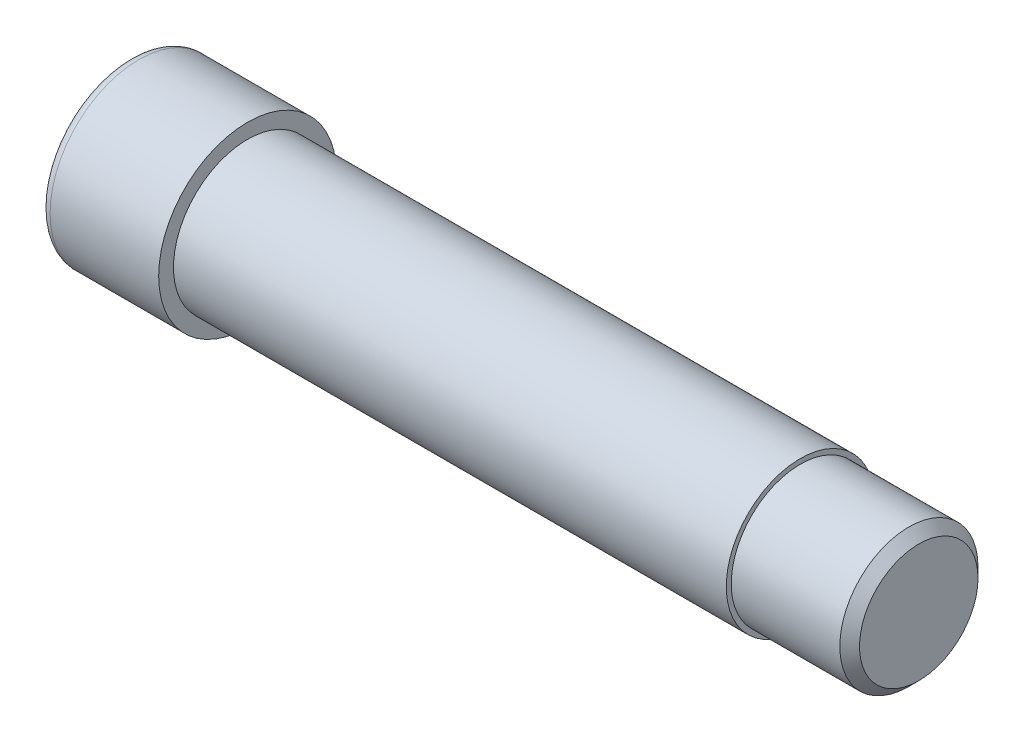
ISO-10303-21;
HEADER;
FILE_DESCRIPTION(('STEP AP214'),'2;1');
FILE_NAME('part.step','',(''),(''),'','','');
FILE_SCHEMA(('AUTOMOTIVE_DESIGN { 1 0 10303 214 1 1 1 1 }'));
ENDSEC;
DATA;
#1=APPLICATION_CONTEXT('core data for automotive mechanical design processes');
#2=APPLICATION_PROTOCOL_DEFINITION('international standard','automotive_design',2000,#1);
#3=PRODUCT_CONTEXT('',#1,'mechanical');
#4=PRODUCT('Part','Part','',(#3));
#5=PRODUCT_RELATED_PRODUCT_CATEGORY('part','',(#4));
#6=PRODUCT_DEFINITION_FORMATION('','',#4);
#7=PRODUCT_DEFINITION_CONTEXT('part definition',#1,'design');
#8=PRODUCT_DEFINITION('design','',#6,#7);
#9=PRODUCT_DEFINITION_SHAPE('','',#8);
#10=(LENGTH_UNIT() NAMED_UNIT(*) SI_UNIT(.MILLI.,.METRE.));
#11=(NAMED_UNIT(*) PLANE_ANGLE_UNIT() SI_UNIT($,.RADIAN.));
#12=(NAMED_UNIT(*) SI_UNIT($,.STERADIAN.) SOLID_ANGLE_UNIT());
#13=UNCERTAINTY_MEASURE_WITH_UNIT(LENGTH_MEASURE(1.E-05),#10,'distance_accuracy_value','');
#14=(GEOMETRIC_REPRESENTATION_CONTEXT(3) GLOBAL_UNCERTAINTY_ASSIGNED_CONTEXT((#13)) GLOBAL_UNIT_ASSIGNED_CONTEXT((#10,
#11,#12)) REPRESENTATION_CONTEXT('',''));
#15=CARTESIAN_POINT('',(0.,0.,0.));
#16=DIRECTION('',(0.,0.,1.));
#17=DIRECTION('',(1.,0.,0.));
#18=AXIS2_PLACEMENT_3D('',#15,#16,#17);
#19=CARTESIAN_POINT('',(-80.,0.,-9.));
#20=DIRECTION('',(-1.,0.,0.));
#21=DIRECTION('',(0.,0.,1.));
#22=AXIS2_PLACEMENT_3D('',#19,#20,#21);
#23=PLANE('',#22);
#24=CARTESIAN_POINT('',(-80.,0.,0.));
#25=DIRECTION('',(-1.,0.,0.));
#26=DIRECTION('',(0.,0.,1.));
#27=AXIS2_PLACEMENT_3D('',#24,#25,#26);
#28=CIRCLE('',#27,8.);
#29=CARTESIAN_POINT('',(-80.,0.,8.));
#30=VERTEX_POINT('',#29);
#31=EDGE_CURVE('E211',#30,#30,#28,.T.);
#32=ORIENTED_EDGE('',*,*,#31,.T.);
#33=EDGE_LOOP('',(#32));
#34=FACE_BOUND('',#33,.T.);
#35=CARTESIAN_POINT('',(-80.,0.,4.42264973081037));
#36=DIRECTION('',(-1.,0.,0.));
#37=DIRECTION('',(0.,0.,1.));
#38=AXIS2_PLACEMENT_3D('',#35,#36,#37);
#39=CIRCLE('',#38,1.);
#40=CARTESIAN_POINT('',(-80.,-0.5,5.28867513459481));
#41=VERTEX_POINT('',#40);
#42=CARTESIAN_POINT('',(-80.,0.5,5.28867513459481));
#43=VERTEX_POINT('',#42);
#44=EDGE_CURVE('E246',#41,#43,#39,.T.);
#45=ORIENTED_EDGE('',*,*,#44,.F.);
#46=DIRECTION('',(0.,0.866025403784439,0.5));
#47=VECTOR('',#46,1.);
#48=CARTESIAN_POINT('',(-80.,-4.5801270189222,2.93301270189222));
#49=LINE('',#48,#47);
#50=CARTESIAN_POINT('',(-80.,-4.33012701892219,3.07735026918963));
#51=VERTEX_POINT('',#50);
#52=EDGE_CURVE('E187',#41,#51,#49,.F.);
#53=ORIENTED_EDGE('',*,*,#52,.T.);
#54=CARTESIAN_POINT('',(-80.,-3.83012701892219,2.21132486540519));
#55=DIRECTION('',(-1.,0.,0.));
#56=DIRECTION('',(0.,0.,1.));
#57=AXIS2_PLACEMENT_3D('',#54,#55,#56);
#58=CIRCLE('',#57,1.);
#59=CARTESIAN_POINT('',(-80.,-4.83012701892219,2.21132486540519));
#60=VERTEX_POINT('',#59);
#61=EDGE_CURVE('E242',#60,#51,#58,.T.);
#62=ORIENTED_EDGE('',*,*,#61,.F.);
#63=DIRECTION('',(0.,0.,1.));
#64=VECTOR('',#63,1.);
#65=CARTESIAN_POINT('',(-80.,-4.83012701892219,-2.5));
#66=LINE('',#65,#64);
#67=CARTESIAN_POINT('',(-80.,-4.83012701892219,-2.21132486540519));
#68=VERTEX_POINT('',#67);
#69=EDGE_CURVE('E240',#60,#68,#66,.F.);
#70=ORIENTED_EDGE('',*,*,#69,.T.);
#71=CARTESIAN_POINT('',(-80.,-3.83012701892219,-2.21132486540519));
#72=DIRECTION('',(-1.,0.,0.));
#73=DIRECTION('',(0.,0.,1.));
#74=AXIS2_PLACEMENT_3D('',#71,#72,#73);
#75=CIRCLE('',#74,1.);
#76=CARTESIAN_POINT('',(-80.,-4.33012701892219,-3.07735026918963));
#77=VERTEX_POINT('',#76);
#78=EDGE_CURVE('E237',#77,#68,#75,.T.);
#79=ORIENTED_EDGE('',*,*,#78,.F.);
#80=DIRECTION('',(0.,-0.866025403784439,0.499999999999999));
#81=VECTOR('',#80,1.);
#82=CARTESIAN_POINT('',(-80.,-0.249999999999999,-5.43301270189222));
#83=LINE('',#82,#81);
#84=CARTESIAN_POINT('',(-80.,-0.499999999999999,-5.28867513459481));
#85=VERTEX_POINT('',#84);
#86=EDGE_CURVE('E233',#77,#85,#83,.F.);
#87=ORIENTED_EDGE('',*,*,#86,.T.);
#88=CARTESIAN_POINT('',(-80.,0.,-4.42264973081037));
#89=DIRECTION('',(-1.,0.,0.));
#90=DIRECTION('',(0.,0.,1.));
#91=AXIS2_PLACEMENT_3D('',#88,#89,#90);
#92=CIRCLE('',#91,1.);
#93=CARTESIAN_POINT('',(-80.,0.5,-5.28867513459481));
#94=VERTEX_POINT('',#93);
#95=EDGE_CURVE('E230',#94,#85,#92,.T.);
#96=ORIENTED_EDGE('',*,*,#95,.F.);
#97=DIRECTION('',(0.,-0.866025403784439,-0.5));
#98=VECTOR('',#97,1.);
#99=CARTESIAN_POINT('',(-80.,4.5801270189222,-2.93301270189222));
#100=LINE('',#99,#98);
#101=CARTESIAN_POINT('',(-80.,4.33012701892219,-3.07735026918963));
#102=VERTEX_POINT('',#101);
#103=EDGE_CURVE('E228',#94,#102,#100,.F.);
#104=ORIENTED_EDGE('',*,*,#103,.T.);
#105=CARTESIAN_POINT('',(-80.,3.83012701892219,-2.21132486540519));
#106=DIRECTION('',(-1.,0.,0.));
#107=DIRECTION('',(0.,0.,1.));
#108=AXIS2_PLACEMENT_3D('',#105,#106,#107);
#109=CIRCLE('',#108,1.);
#110=CARTESIAN_POINT('',(-80.,4.83012701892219,-2.21132486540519));
#111=VERTEX_POINT('',#110);
#112=EDGE_CURVE('E225',#111,#102,#109,.T.);
#113=ORIENTED_EDGE('',*,*,#112,.F.);
#114=DIRECTION('',(0.,0.,-1.));
#115=VECTOR('',#114,1.);
#116=CARTESIAN_POINT('',(-80.,4.83012701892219,2.5));
#117=LINE('',#116,#115);
#118=CARTESIAN_POINT('',(-80.,4.83012701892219,2.21132486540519));
#119=VERTEX_POINT('',#118);
#120=EDGE_CURVE('E219',#111,#119,#117,.F.);
#121=ORIENTED_EDGE('',*,*,#120,.T.);
#122=CARTESIAN_POINT('',(-80.,3.83012701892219,2.21132486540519));
#123=DIRECTION('',(-1.,0.,0.));
#124=DIRECTION('',(0.,0.,1.));
#125=AXIS2_PLACEMENT_3D('',#122,#123,#124);
#126=CIRCLE('',#125,1.);
#127=CARTESIAN_POINT('',(-80.,4.33012701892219,3.07735026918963));
#128=VERTEX_POINT('',#127);
#129=EDGE_CURVE('E217',#128,#119,#126,.T.);
#130=ORIENTED_EDGE('',*,*,#129,.F.);
#131=DIRECTION('',(0.,0.866025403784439,-0.5));
#132=VECTOR('',#131,1.);
#133=CARTESIAN_POINT('',(-80.,0.249999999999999,5.43301270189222));
#134=LINE('',#133,#132);
#135=EDGE_CURVE('E235',#128,#43,#134,.F.);
#136=ORIENTED_EDGE('',*,*,#135,.T.);
#137=EDGE_LOOP('',(#45,#53,#62,#70,#79,#87,#96,#104,#113,#121,#130,#136));
#138=FACE_BOUND('',#137,.T.);
#139=ADVANCED_FACE('F34',(#34,#138),#23,.T.);
#140=CARTESIAN_POINT('',(0.,0.,0.));
#141=DIRECTION('',(1.,0.,0.));
#142=DIRECTION('',(0.,0.,-1.));
#143=AXIS2_PLACEMENT_3D('',#140,#141,#142);
#144=PLANE('',#143);
#145=CARTESIAN_POINT('',(0.,0.,0.));
#146=DIRECTION('',(1.,0.,0.));
#147=DIRECTION('',(0.,0.,-1.));
#148=AXIS2_PLACEMENT_3D('',#145,#146,#147);
#149=CIRCLE('',#148,6.00000000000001);
#150=CARTESIAN_POINT('',(0.,0.,-6.00000000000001));
#151=VERTEX_POINT('',#150);
#152=EDGE_CURVE('E411',#151,#151,#149,.T.);
#153=ORIENTED_EDGE('',*,*,#152,.T.);
#154=EDGE_LOOP('',(#153));
#155=FACE_BOUND('',#154,.T.);
#156=ADVANCED_FACE('F466',(#155),#144,.T.);
#157=CARTESIAN_POINT('',(0.,0.,0.));
#158=DIRECTION('',(1.,0.,0.));
#159=DIRECTION('',(0.,0.,-1.));
#160=AXIS2_PLACEMENT_3D('',#157,#158,#159);
#161=CYLINDRICAL_SURFACE('',#160,7.);
#162=CARTESIAN_POINT('',(-0.99999999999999,0.,0.));
#163=DIRECTION('',(1.,0.,0.));
#164=DIRECTION('',(0.,0.,-1.));
#165=AXIS2_PLACEMENT_3D('',#162,#163,#164);
#166=CIRCLE('',#165,7.);
#167=CARTESIAN_POINT('',(-0.99999999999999,0.,-7.));
#168=VERTEX_POINT('',#167);
#169=EDGE_CURVE('E414',#168,#168,#166,.F.);
#170=ORIENTED_EDGE('',*,*,#169,.T.);
#171=EDGE_LOOP('',(#170));
#172=FACE_BOUND('',#171,.T.);
#173=CARTESIAN_POINT('',(-12.,0.,0.));
#174=DIRECTION('',(1.,0.,0.));
#175=DIRECTION('',(0.,0.,-1.));
#176=AXIS2_PLACEMENT_3D('',#173,#174,#175);
#177=CIRCLE('',#176,7.);
#178=CARTESIAN_POINT('',(-12.,0.,-7.));
#179=VERTEX_POINT('',#178);
#180=EDGE_CURVE('E408',#179,#179,#177,.T.);
#181=ORIENTED_EDGE('',*,*,#180,.T.);
#182=EDGE_LOOP('',(#181));
#183=FACE_BOUND('',#182,.T.);
#184=ADVANCED_FACE('F472',(#172,#183),#161,.T.);
#185=CARTESIAN_POINT('',(-12.,0.,-7.));
#186=DIRECTION('',(1.,0.,0.));
#187=DIRECTION('',(0.,0.,-1.));
#188=AXIS2_PLACEMENT_3D('',#185,#186,#187);
#189=PLANE('',#188);
#190=CARTESIAN_POINT('',(-12.,0.,0.));
#191=DIRECTION('',(1.,0.,0.));
#192=DIRECTION('',(0.,0.,-1.));
#193=AXIS2_PLACEMENT_3D('',#190,#191,#192);
#194=CIRCLE('',#193,7.5);
#195=CARTESIAN_POINT('',(-12.,0.,-7.5));
#196=VERTEX_POINT('',#195);
#197=EDGE_CURVE('E403',#196,#196,#194,.T.);
#198=ORIENTED_EDGE('',*,*,#197,.T.);
#199=EDGE_LOOP('',(#198));
#200=FACE_BOUND('',#199,.T.);
#201=ORIENTED_EDGE('',*,*,#180,.F.);
#202=EDGE_LOOP('',(#201));
#203=FACE_BOUND('',#202,.T.);
#204=ADVANCED_FACE('F490',(#200,#203),#189,.T.);
#205=CARTESIAN_POINT('',(0.,0.,0.));
#206=DIRECTION('',(1.,0.,0.));
#207=DIRECTION('',(0.,0.,-1.));
#208=AXIS2_PLACEMENT_3D('',#205,#206,#207);
#209=CYLINDRICAL_SURFACE('',#208,7.5);
#210=CARTESIAN_POINT('',(-68.,0.,0.));
#211=DIRECTION('',(1.,0.,0.));
#212=DIRECTION('',(0.,0.,-1.));
#213=AXIS2_PLACEMENT_3D('',#210,#211,#212);
#214=CIRCLE('',#213,7.49999999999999);
#215=CARTESIAN_POINT('',(-68.,0.,-7.49999999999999));
#216=VERTEX_POINT('',#215);
#217=EDGE_CURVE('E398',#216,#216,#214,.T.);
#218=ORIENTED_EDGE('',*,*,#217,.T.);
#219=EDGE_LOOP('',(#218));
#220=FACE_BOUND('',#219,.T.);
#221=ORIENTED_EDGE('',*,*,#197,.F.);
#222=EDGE_LOOP('',(#221));
#223=FACE_BOUND('',#222,.T.);
#224=ADVANCED_FACE('F487',(#220,#223),#209,.T.);
#225=CARTESIAN_POINT('',(-68.,0.,-7.49999999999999));
#226=DIRECTION('',(1.,0.,0.));
#227=DIRECTION('',(0.,0.,-1.));
#228=AXIS2_PLACEMENT_3D('',#225,#226,#227);
#229=PLANE('',#228);
#230=CARTESIAN_POINT('',(-68.,0.,0.));
#231=DIRECTION('',(1.,0.,0.));
#232=DIRECTION('',(0.,0.,-1.));
#233=AXIS2_PLACEMENT_3D('',#230,#231,#232);
#234=CIRCLE('',#233,9.);
#235=CARTESIAN_POINT('',(-68.,0.,-9.));
#236=VERTEX_POINT('',#235);
#237=EDGE_CURVE('E391',#236,#236,#234,.T.);
#238=ORIENTED_EDGE('',*,*,#237,.T.);
#239=EDGE_LOOP('',(#238));
#240=FACE_BOUND('',#239,.T.);
#241=ORIENTED_EDGE('',*,*,#217,.F.);
#242=EDGE_LOOP('',(#241));
#243=FACE_BOUND('',#242,.T.);
#244=ADVANCED_FACE('F483',(#240,#243),#229,.T.);
#245=CARTESIAN_POINT('',(0.,0.,0.));
#246=DIRECTION('',(1.,0.,0.));
#247=DIRECTION('',(0.,0.,-1.));
#248=AXIS2_PLACEMENT_3D('',#245,#246,#247);
#249=CYLINDRICAL_SURFACE('',#248,9.);
#250=CARTESIAN_POINT('',(-79.,0.,0.));
#251=DIRECTION('',(-1.,0.,0.));
#252=DIRECTION('',(0.,0.,1.));
#253=AXIS2_PLACEMENT_3D('',#250,#251,#252);
#254=CIRCLE('',#253,9.);
#255=CARTESIAN_POINT('',(-79.,0.,9.));
#256=VERTEX_POINT('',#255);
#257=EDGE_CURVE('E417',#256,#256,#254,.F.);
#258=ORIENTED_EDGE('',*,*,#257,.T.);
#259=EDGE_LOOP('',(#258));
#260=FACE_BOUND('',#259,.T.);
#261=ORIENTED_EDGE('',*,*,#237,.F.);
#262=EDGE_LOOP('',(#261));
#263=FACE_BOUND('',#262,.T.);
#264=ADVANCED_FACE('F479',(#260,#263),#249,.T.);
#265=CARTESIAN_POINT('',(0.,0.,0.));
#266=DIRECTION('',(-1.,0.,0.));
#267=DIRECTION('',(0.,0.,1.));
#268=AXIS2_PLACEMENT_3D('',#265,#266,#267);
#269=CONICAL_SURFACE('',#268,6.00000000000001,0.78539816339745);
#270=ORIENTED_EDGE('',*,*,#169,.F.);
#271=EDGE_LOOP('',(#270));
#272=FACE_BOUND('',#271,.T.);
#273=ORIENTED_EDGE('',*,*,#152,.F.);
#274=EDGE_LOOP('',(#273));
#275=FACE_BOUND('',#274,.T.);
#276=ADVANCED_FACE('F482',(#272,#275),#269,.T.);
#277=CARTESIAN_POINT('',(-79.,0.,0.));
#278=DIRECTION('',(-1.,0.,0.));
#279=DIRECTION('',(0.,0.,1.));
#280=AXIS2_PLACEMENT_3D('',#277,#278,#279);
#281=TOROIDAL_SURFACE('',#280,8.,1.);
#282=ORIENTED_EDGE('',*,*,#31,.F.);
#283=EDGE_LOOP('',(#282));
#284=FACE_BOUND('',#283,.T.);
#285=ORIENTED_EDGE('',*,*,#257,.F.);
#286=EDGE_LOOP('',(#285));
#287=FACE_BOUND('',#286,.T.);
#288=ADVANCED_FACE('F500',(#284,#287),#281,.T.);
#289=CARTESIAN_POINT('',(-70.,0.,-5.));
#290=DIRECTION('',(0.,0.5,-0.866025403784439));
#291=DIRECTION('',(0.,0.866025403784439,0.5));
#292=AXIS2_PLACEMENT_3D('',#289,#290,#291);
#293=PLANE('',#292);
#294=DIRECTION('',(-1.,0.,0.));
#295=VECTOR('',#294,1.);
#296=CARTESIAN_POINT('',(-80.,4.08012701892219,-2.64433756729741));
#297=LINE('',#296,#295);
#298=CARTESIAN_POINT('',(-70.5,4.08012701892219,-2.64433756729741));
#299=VERTEX_POINT('',#298);
#300=CARTESIAN_POINT('',(-79.5,4.08012701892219,-2.64433756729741));
#301=VERTEX_POINT('',#300);
#302=EDGE_CURVE('E277',#299,#301,#297,.T.);
#303=ORIENTED_EDGE('',*,*,#302,.T.);
#304=DIRECTION('',(0.,-0.866025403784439,-0.5));
#305=VECTOR('',#304,1.);
#306=CARTESIAN_POINT('',(-79.5,0.,-5.));
#307=LINE('',#306,#305);
#308=CARTESIAN_POINT('',(-79.5,0.25,-4.85566243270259));
#309=VERTEX_POINT('',#308);
#310=EDGE_CURVE('E282',#301,#309,#307,.T.);
#311=ORIENTED_EDGE('',*,*,#310,.T.);
#312=DIRECTION('',(-1.,0.,0.));
#313=VECTOR('',#312,1.);
#314=CARTESIAN_POINT('',(-70.,0.25,-4.85566243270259));
#315=LINE('',#314,#313);
#316=CARTESIAN_POINT('',(-70.5,0.25,-4.85566243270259));
#317=VERTEX_POINT('',#316);
#318=EDGE_CURVE('E279',#309,#317,#315,.F.);
#319=ORIENTED_EDGE('',*,*,#318,.T.);
#320=DIRECTION('',(0.,-0.866025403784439,-0.5));
#321=VECTOR('',#320,1.);
#322=CARTESIAN_POINT('',(-70.5,4.33012701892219,-2.5));
#323=LINE('',#322,#321);
#324=EDGE_CURVE('E275',#317,#299,#323,.F.);
#325=ORIENTED_EDGE('',*,*,#324,.T.);
#326=EDGE_LOOP('',(#303,#311,#319,#325));
#327=FACE_BOUND('',#326,.T.);
#328=ADVANCED_FACE('F477',(#327),#293,.F.);
#329=CARTESIAN_POINT('',(-70.,4.33012701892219,-2.5));
#330=DIRECTION('',(0.,1.,0.));
#331=DIRECTION('',(0.,0.,1.));
#332=AXIS2_PLACEMENT_3D('',#329,#330,#331);
#333=PLANE('',#332);
#334=DIRECTION('',(-1.,0.,0.));
#335=VECTOR('',#334,1.);
#336=CARTESIAN_POINT('',(-80.,4.33012701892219,2.21132486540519));
#337=LINE('',#336,#335);
#338=CARTESIAN_POINT('',(-70.5,4.33012701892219,2.21132486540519));
#339=VERTEX_POINT('',#338);
#340=CARTESIAN_POINT('',(-79.5,4.33012701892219,2.21132486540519));
#341=VERTEX_POINT('',#340);
#342=EDGE_CURVE('E43',#339,#341,#337,.T.);
#343=ORIENTED_EDGE('',*,*,#342,.T.);
#344=DIRECTION('',(0.,0.,-1.));
#345=VECTOR('',#344,1.);
#346=CARTESIAN_POINT('',(-79.5,4.33012701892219,-2.5));
#347=LINE('',#346,#345);
#348=CARTESIAN_POINT('',(-79.5,4.33012701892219,-2.21132486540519));
#349=VERTEX_POINT('',#348);
#350=EDGE_CURVE('E11',#341,#349,#347,.T.);
#351=ORIENTED_EDGE('',*,*,#350,.T.);
#352=DIRECTION('',(-1.,0.,0.));
#353=VECTOR('',#352,1.);
#354=CARTESIAN_POINT('',(-70.,4.33012701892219,-2.21132486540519));
#355=LINE('',#354,#353);
#356=CARTESIAN_POINT('',(-70.5,4.33012701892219,-2.21132486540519));
#357=VERTEX_POINT('',#356);
#358=EDGE_CURVE('E299',#349,#357,#355,.F.);
#359=ORIENTED_EDGE('',*,*,#358,.T.);
#360=DIRECTION('',(0.,0.,-1.));
#361=VECTOR('',#360,1.);
#362=CARTESIAN_POINT('',(-70.5,4.33012701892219,2.5));
#363=LINE('',#362,#361);
#364=EDGE_CURVE('E297',#357,#339,#363,.F.);
#365=ORIENTED_EDGE('',*,*,#364,.T.);
#366=EDGE_LOOP('',(#343,#351,#359,#365));
#367=FACE_BOUND('',#366,.T.);
#368=ADVANCED_FACE('F815',(#367),#333,.F.);
#369=CARTESIAN_POINT('',(-70.,4.33012701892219,2.5));
#370=DIRECTION('',(0.,0.5,0.866025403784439));
#371=DIRECTION('',(0.,-0.866025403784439,0.5));
#372=AXIS2_PLACEMENT_3D('',#369,#370,#371);
#373=PLANE('',#372);
#374=DIRECTION('',(0.,0.866025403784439,-0.5));
#375=VECTOR('',#374,1.);
#376=CARTESIAN_POINT('',(-70.5,0.,5.));
#377=LINE('',#376,#375);
#378=CARTESIAN_POINT('',(-70.5,4.08012701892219,2.64433756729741));
#379=VERTEX_POINT('',#378);
#380=CARTESIAN_POINT('',(-70.5,0.250000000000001,4.85566243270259));
#381=VERTEX_POINT('',#380);
#382=EDGE_CURVE('E259',#379,#381,#377,.F.);
#383=ORIENTED_EDGE('',*,*,#382,.T.);
#384=DIRECTION('',(-1.,0.,0.));
#385=VECTOR('',#384,1.);
#386=CARTESIAN_POINT('',(-80.,0.250000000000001,4.85566243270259));
#387=LINE('',#386,#385);
#388=CARTESIAN_POINT('',(-79.5,0.250000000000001,4.85566243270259));
#389=VERTEX_POINT('',#388);
#390=EDGE_CURVE('E264',#381,#389,#387,.T.);
#391=ORIENTED_EDGE('',*,*,#390,.T.);
#392=DIRECTION('',(0.,0.866025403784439,-0.5));
#393=VECTOR('',#392,1.);
#394=CARTESIAN_POINT('',(-79.5,4.33012701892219,2.5));
#395=LINE('',#394,#393);
#396=CARTESIAN_POINT('',(-79.5,4.08012701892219,2.64433756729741));
#397=VERTEX_POINT('',#396);
#398=EDGE_CURVE('E261',#389,#397,#395,.T.);
#399=ORIENTED_EDGE('',*,*,#398,.T.);
#400=DIRECTION('',(-1.,0.,0.));
#401=VECTOR('',#400,1.);
#402=CARTESIAN_POINT('',(-70.,4.08012701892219,2.64433756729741));
#403=LINE('',#402,#401);
#404=EDGE_CURVE('E257',#397,#379,#403,.F.);
#405=ORIENTED_EDGE('',*,*,#404,.T.);
#406=EDGE_LOOP('',(#383,#391,#399,#405));
#407=FACE_BOUND('',#406,.T.);
#408=ADVANCED_FACE('F445',(#407),#373,.F.);
#409=CARTESIAN_POINT('',(-70.,0.,5.));
#410=DIRECTION('',(0.,-0.5,0.866025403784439));
#411=DIRECTION('',(0.,-0.866025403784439,-0.5));
#412=AXIS2_PLACEMENT_3D('',#409,#410,#411);
#413=PLANE('',#412);
#414=DIRECTION('',(-1.,0.,0.));
#415=VECTOR('',#414,1.);
#416=CARTESIAN_POINT('',(-80.,-4.08012701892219,2.64433756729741));
#417=LINE('',#416,#415);
#418=CARTESIAN_POINT('',(-70.5,-4.08012701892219,2.64433756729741));
#419=VERTEX_POINT('',#418);
#420=CARTESIAN_POINT('',(-79.5,-4.08012701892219,2.64433756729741));
#421=VERTEX_POINT('',#420);
#422=EDGE_CURVE('E215',#419,#421,#417,.T.);
#423=ORIENTED_EDGE('',*,*,#422,.T.);
#424=DIRECTION('',(0.,0.866025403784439,0.5));
#425=VECTOR('',#424,1.);
#426=CARTESIAN_POINT('',(-79.5,0.,5.));
#427=LINE('',#426,#425);
#428=CARTESIAN_POINT('',(-79.5,-0.25,4.85566243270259));
#429=VERTEX_POINT('',#428);
#430=EDGE_CURVE('E185',#421,#429,#427,.T.);
#431=ORIENTED_EDGE('',*,*,#430,.T.);
#432=DIRECTION('',(-1.,0.,0.));
#433=VECTOR('',#432,1.);
#434=CARTESIAN_POINT('',(-70.,-0.25,4.85566243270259));
#435=LINE('',#434,#433);
#436=CARTESIAN_POINT('',(-70.5,-0.25,4.85566243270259));
#437=VERTEX_POINT('',#436);
#438=EDGE_CURVE('E204',#429,#437,#435,.F.);
#439=ORIENTED_EDGE('',*,*,#438,.T.);
#440=DIRECTION('',(0.,0.866025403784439,0.5));
#441=VECTOR('',#440,1.);
#442=CARTESIAN_POINT('',(-70.5,-4.3301270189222,2.5));
#443=LINE('',#442,#441);
#444=EDGE_CURVE('E210',#437,#419,#443,.F.);
#445=ORIENTED_EDGE('',*,*,#444,.T.);
#446=EDGE_LOOP('',(#423,#431,#439,#445));
#447=FACE_BOUND('',#446,.T.);
#448=ADVANCED_FACE('F213',(#447),#413,.F.);
#449=CARTESIAN_POINT('',(-70.,-4.33012701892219,2.5));
#450=DIRECTION('',(0.,-1.,0.));
#451=DIRECTION('',(0.,0.,-1.));
#452=AXIS2_PLACEMENT_3D('',#449,#450,#451);
#453=PLANE('',#452);
#454=DIRECTION('',(-1.,0.,0.));
#455=VECTOR('',#454,1.);
#456=CARTESIAN_POINT('',(-80.,-4.33012701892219,-2.21132486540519));
#457=LINE('',#456,#455);
#458=CARTESIAN_POINT('',(-70.5,-4.33012701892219,-2.21132486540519));
#459=VERTEX_POINT('',#458);
#460=CARTESIAN_POINT('',(-79.5,-4.33012701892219,-2.21132486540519));
#461=VERTEX_POINT('',#460);
#462=EDGE_CURVE('E252',#459,#461,#457,.T.);
#463=ORIENTED_EDGE('',*,*,#462,.T.);
#464=DIRECTION('',(0.,0.,1.));
#465=VECTOR('',#464,1.);
#466=CARTESIAN_POINT('',(-79.5,-4.33012701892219,2.5));
#467=LINE('',#466,#465);
#468=CARTESIAN_POINT('',(-79.5,-4.33012701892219,2.21132486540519));
#469=VERTEX_POINT('',#468);
#470=EDGE_CURVE('E254',#461,#469,#467,.T.);
#471=ORIENTED_EDGE('',*,*,#470,.T.);
#472=DIRECTION('',(-1.,0.,0.));
#473=VECTOR('',#472,1.);
#474=CARTESIAN_POINT('',(-70.,-4.33012701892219,2.21132486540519));
#475=LINE('',#474,#473);
#476=CARTESIAN_POINT('',(-70.5,-4.33012701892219,2.21132486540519));
#477=VERTEX_POINT('',#476);
#478=EDGE_CURVE('E248',#469,#477,#475,.F.);
#479=ORIENTED_EDGE('',*,*,#478,.T.);
#480=DIRECTION('',(0.,0.,1.));
#481=VECTOR('',#480,1.);
#482=CARTESIAN_POINT('',(-70.5,-4.33012701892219,-2.5));
#483=LINE('',#482,#481);
#484=EDGE_CURVE('E250',#477,#459,#483,.F.);
#485=ORIENTED_EDGE('',*,*,#484,.T.);
#486=EDGE_LOOP('',(#463,#471,#479,#485));
#487=FACE_BOUND('',#486,.T.);
#488=ADVANCED_FACE('F793',(#487),#453,.F.);
#489=CARTESIAN_POINT('',(-70.,-4.33012701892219,-2.5));
#490=DIRECTION('',(0.,-0.499999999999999,-0.866025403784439));
#491=DIRECTION('',(0.,0.866025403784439,-0.499999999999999));
#492=AXIS2_PLACEMENT_3D('',#489,#490,#491);
#493=PLANE('',#492);
#494=DIRECTION('',(0.,-0.866025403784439,0.499999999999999));
#495=VECTOR('',#494,1.);
#496=CARTESIAN_POINT('',(-70.5,0.,-5.));
#497=LINE('',#496,#495);
#498=CARTESIAN_POINT('',(-70.5,-4.08012701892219,-2.64433756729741));
#499=VERTEX_POINT('',#498);
#500=CARTESIAN_POINT('',(-70.5,-0.249999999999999,-4.85566243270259));
#501=VERTEX_POINT('',#500);
#502=EDGE_CURVE('E270',#499,#501,#497,.F.);
#503=ORIENTED_EDGE('',*,*,#502,.T.);
#504=DIRECTION('',(-1.,0.,0.));
#505=VECTOR('',#504,1.);
#506=CARTESIAN_POINT('',(-80.,-0.249999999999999,-4.85566243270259));
#507=LINE('',#506,#505);
#508=CARTESIAN_POINT('',(-79.5,-0.249999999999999,-4.85566243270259));
#509=VERTEX_POINT('',#508);
#510=EDGE_CURVE('E272',#501,#509,#507,.T.);
#511=ORIENTED_EDGE('',*,*,#510,.T.);
#512=DIRECTION('',(0.,-0.866025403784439,0.499999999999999));
#513=VECTOR('',#512,1.);
#514=CARTESIAN_POINT('',(-79.5,-4.33012701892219,-2.5));
#515=LINE('',#514,#513);
#516=CARTESIAN_POINT('',(-79.5,-4.08012701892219,-2.64433756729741));
#517=VERTEX_POINT('',#516);
#518=EDGE_CURVE('E266',#509,#517,#515,.T.);
#519=ORIENTED_EDGE('',*,*,#518,.T.);
#520=DIRECTION('',(-1.,0.,0.));
#521=VECTOR('',#520,1.);
#522=CARTESIAN_POINT('',(-70.,-4.08012701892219,-2.64433756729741));
#523=LINE('',#522,#521);
#524=EDGE_CURVE('E268',#517,#499,#523,.F.);
#525=ORIENTED_EDGE('',*,*,#524,.T.);
#526=EDGE_LOOP('',(#503,#511,#519,#525));
#527=FACE_BOUND('',#526,.T.);
#528=ADVANCED_FACE('F539',(#527),#493,.F.);
#529=CARTESIAN_POINT('',(-70.,0.,0.));
#530=DIRECTION('',(1.,0.,0.));
#531=DIRECTION('',(0.,0.,-1.));
#532=AXIS2_PLACEMENT_3D('',#529,#530,#531);
#533=PLANE('',#532);
#534=DIRECTION('',(0.,-0.866025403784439,0.499999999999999));
#535=VECTOR('',#534,1.);
#536=CARTESIAN_POINT('',(-70.,-4.08012701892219,-2.06698729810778));
#537=LINE('',#536,#535);
#538=CARTESIAN_POINT('',(-70.,0.,-4.42264973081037));
#539=VERTEX_POINT('',#538);
#540=CARTESIAN_POINT('',(-70.,-3.83012701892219,-2.21132486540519));
#541=VERTEX_POINT('',#540);
#542=EDGE_CURVE('E290',#539,#541,#537,.T.);
#543=ORIENTED_EDGE('',*,*,#542,.T.);
#544=DIRECTION('',(0.,0.,1.));
#545=VECTOR('',#544,1.);
#546=CARTESIAN_POINT('',(-70.,-3.83012701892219,2.5));
#547=LINE('',#546,#545);
#548=CARTESIAN_POINT('',(-70.,-3.83012701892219,2.21132486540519));
#549=VERTEX_POINT('',#548);
#550=EDGE_CURVE('E295',#541,#549,#547,.T.);
#551=ORIENTED_EDGE('',*,*,#550,.T.);
#552=DIRECTION('',(0.,0.866025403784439,0.5));
#553=VECTOR('',#552,1.);
#554=CARTESIAN_POINT('',(-70.,0.25,4.56698729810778));
#555=LINE('',#554,#553);
#556=CARTESIAN_POINT('',(-70.,0.,4.42264973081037));
#557=VERTEX_POINT('',#556);
#558=EDGE_CURVE('E293',#549,#557,#555,.T.);
#559=ORIENTED_EDGE('',*,*,#558,.T.);
#560=DIRECTION('',(0.,0.866025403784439,-0.5));
#561=VECTOR('',#560,1.);
#562=CARTESIAN_POINT('',(-70.,4.08012701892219,2.06698729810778));
#563=LINE('',#562,#561);
#564=CARTESIAN_POINT('',(-70.,3.83012701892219,2.21132486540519));
#565=VERTEX_POINT('',#564);
#566=EDGE_CURVE('E288',#557,#565,#563,.T.);
#567=ORIENTED_EDGE('',*,*,#566,.T.);
#568=DIRECTION('',(0.,0.,-1.));
#569=VECTOR('',#568,1.);
#570=CARTESIAN_POINT('',(-70.,3.83012701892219,-2.5));
#571=LINE('',#570,#569);
#572=CARTESIAN_POINT('',(-70.,3.83012701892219,-2.21132486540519));
#573=VERTEX_POINT('',#572);
#574=EDGE_CURVE('E284',#565,#573,#571,.T.);
#575=ORIENTED_EDGE('',*,*,#574,.T.);
#576=DIRECTION('',(0.,-0.866025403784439,-0.5));
#577=VECTOR('',#576,1.);
#578=CARTESIAN_POINT('',(-70.,-0.250000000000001,-4.56698729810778));
#579=LINE('',#578,#577);
#580=EDGE_CURVE('E286',#573,#539,#579,.T.);
#581=ORIENTED_EDGE('',*,*,#580,.T.);
#582=EDGE_LOOP('',(#543,#551,#559,#567,#575,#581));
#583=FACE_BOUND('',#582,.T.);
#584=ADVANCED_FACE('F554',(#583),#533,.F.);
#585=CARTESIAN_POINT('',(-70.5,1.9150635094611,-3.31698729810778));
#586=DIRECTION('',(0.,0.866025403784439,0.5));
#587=DIRECTION('',(0.,-0.5,0.866025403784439));
#588=AXIS2_PLACEMENT_3D('',#585,#586,#587);
#589=CYLINDRICAL_SURFACE('',#588,0.5);
#590=CARTESIAN_POINT('',(-70.5,0.,-4.42264973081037));
#591=DIRECTION('',(0.,0.866025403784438,0.500000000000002));
#592=DIRECTION('',(0.,-0.500000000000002,0.866025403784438));
#593=AXIS2_PLACEMENT_3D('',#590,#591,#592);
#594=CIRCLE('',#593,0.5);
#595=EDGE_CURVE('E38',#539,#317,#594,.T.);
#596=ORIENTED_EDGE('',*,*,#595,.F.);
#597=ORIENTED_EDGE('',*,*,#580,.F.);
#598=CARTESIAN_POINT('',(-70.5,3.83012701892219,-2.21132486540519));
#599=DIRECTION('',(0.,-0.866025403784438,-0.500000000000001));
#600=DIRECTION('',(0.,0.500000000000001,-0.866025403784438));
#601=AXIS2_PLACEMENT_3D('',#598,#599,#600);
#602=CIRCLE('',#601,0.5);
#603=EDGE_CURVE('E384',#299,#573,#602,.T.);
#604=ORIENTED_EDGE('',*,*,#603,.F.);
#605=ORIENTED_EDGE('',*,*,#324,.F.);
#606=EDGE_LOOP('',(#596,#597,#604,#605));
#607=FACE_BOUND('',#606,.T.);
#608=ADVANCED_FACE('F36',(#607),#589,.F.);
#609=CARTESIAN_POINT('',(-70.5,0.,-4.42264973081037));
#610=DIRECTION('',(0.,0.,1.));
#611=DIRECTION('',(1.,0.,0.));
#612=AXIS2_PLACEMENT_3D('',#609,#610,#611);
#613=SPHERICAL_SURFACE('',#612,0.5);
#614=CARTESIAN_POINT('',(-70.5,0.,-4.42264973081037));
#615=DIRECTION('',(0.,-0.866025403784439,0.499999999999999));
#616=DIRECTION('',(0.,-0.499999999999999,-0.866025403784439));
#617=AXIS2_PLACEMENT_3D('',#614,#615,#616);
#618=CIRCLE('',#617,0.5);
#619=EDGE_CURVE('E380',#539,#501,#618,.F.);
#620=ORIENTED_EDGE('',*,*,#619,.F.);
#621=ORIENTED_EDGE('',*,*,#595,.T.);
#622=CARTESIAN_POINT('',(-70.5,0.,-4.42264973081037));
#623=DIRECTION('',(-1.,0.,0.));
#624=DIRECTION('',(0.,0.,1.));
#625=AXIS2_PLACEMENT_3D('',#622,#623,#624);
#626=CIRCLE('',#625,0.5);
#627=EDGE_CURVE('E383',#501,#317,#626,.F.);
#628=ORIENTED_EDGE('',*,*,#627,.F.);
#629=EDGE_LOOP('',(#620,#621,#628));
#630=FACE_BOUND('',#629,.T.);
#631=ADVANCED_FACE('F546',(#630),#613,.F.);
#632=CARTESIAN_POINT('',(-70.5,3.83012701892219,-2.21132486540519));
#633=DIRECTION('',(0.,0.,1.));
#634=DIRECTION('',(1.,0.,0.));
#635=AXIS2_PLACEMENT_3D('',#632,#633,#634);
#636=SPHERICAL_SURFACE('',#635,0.5);
#637=CARTESIAN_POINT('',(-70.5,3.83012701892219,-2.21132486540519));
#638=DIRECTION('',(-1.,0.,0.));
#639=DIRECTION('',(0.,0.,1.));
#640=AXIS2_PLACEMENT_3D('',#637,#638,#639);
#641=CIRCLE('',#640,0.5);
#642=EDGE_CURVE('E374',#299,#357,#641,.F.);
#643=ORIENTED_EDGE('',*,*,#642,.F.);
#644=ORIENTED_EDGE('',*,*,#603,.T.);
#645=CARTESIAN_POINT('',(-70.5,3.83012701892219,-2.21132486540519));
#646=DIRECTION('',(0.,0.,1.));
#647=DIRECTION('',(0.,-1.,0.));
#648=AXIS2_PLACEMENT_3D('',#645,#646,#647);
#649=CIRCLE('',#648,0.5);
#650=EDGE_CURVE('E377',#357,#573,#649,.F.);
#651=ORIENTED_EDGE('',*,*,#650,.F.);
#652=EDGE_LOOP('',(#643,#644,#651));
#653=FACE_BOUND('',#652,.T.);
#654=ADVANCED_FACE('F548',(#653),#636,.F.);
#655=CARTESIAN_POINT('',(-70.,0.,-4.42264973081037));
#656=DIRECTION('',(1.,0.,0.));
#657=DIRECTION('',(0.,0.,-1.));
#658=AXIS2_PLACEMENT_3D('',#655,#656,#657);
#659=CYLINDRICAL_SURFACE('',#658,0.5);
#660=ORIENTED_EDGE('',*,*,#627,.T.);
#661=ORIENTED_EDGE('',*,*,#318,.F.);
#662=CARTESIAN_POINT('',(-79.5,0.,-4.42264973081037));
#663=DIRECTION('',(-1.,0.,0.));
#664=DIRECTION('',(0.,0.,1.));
#665=AXIS2_PLACEMENT_3D('',#662,#663,#664);
#666=CIRCLE('',#665,0.5);
#667=EDGE_CURVE('E368',#509,#309,#666,.F.);
#668=ORIENTED_EDGE('',*,*,#667,.F.);
#669=ORIENTED_EDGE('',*,*,#510,.F.);
#670=EDGE_LOOP('',(#660,#661,#668,#669));
#671=FACE_BOUND('',#670,.T.);
#672=ADVANCED_FACE('F536',(#671),#659,.F.);
#673=CARTESIAN_POINT('',(-70.5,-1.9150635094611,-3.31698729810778));
#674=DIRECTION('',(0.,0.866025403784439,-0.499999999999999));
#675=DIRECTION('',(0.,0.499999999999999,0.866025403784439));
#676=AXIS2_PLACEMENT_3D('',#673,#674,#675);
#677=CYLINDRICAL_SURFACE('',#676,0.5);
#678=ORIENTED_EDGE('',*,*,#619,.T.);
#679=ORIENTED_EDGE('',*,*,#502,.F.);
#680=CARTESIAN_POINT('',(-70.5,-3.83012701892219,-2.21132486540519));
#681=DIRECTION('',(0.,0.866025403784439,-0.5));
#682=DIRECTION('',(0.,0.5,0.866025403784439));
#683=AXIS2_PLACEMENT_3D('',#680,#681,#682);
#684=CIRCLE('',#683,0.5);
#685=EDGE_CURVE('E365',#541,#499,#684,.T.);
#686=ORIENTED_EDGE('',*,*,#685,.F.);
#687=ORIENTED_EDGE('',*,*,#542,.F.);
#688=EDGE_LOOP('',(#678,#679,#686,#687));
#689=FACE_BOUND('',#688,.T.);
#690=ADVANCED_FACE('F545',(#689),#677,.F.);
#691=CARTESIAN_POINT('',(-70.5,3.83012701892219,0.));
#692=DIRECTION('',(0.,0.,1.));
#693=DIRECTION('',(1.,0.,0.));
#694=AXIS2_PLACEMENT_3D('',#691,#692,#693);
#695=CYLINDRICAL_SURFACE('',#694,0.5);
#696=ORIENTED_EDGE('',*,*,#650,.T.);
#697=ORIENTED_EDGE('',*,*,#574,.F.);
#698=CARTESIAN_POINT('',(-70.5,3.83012701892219,2.21132486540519));
#699=DIRECTION('',(0.,0.,-1.));
#700=DIRECTION('',(-1.,0.,0.));
#701=AXIS2_PLACEMENT_3D('',#698,#699,#700);
#702=CIRCLE('',#701,0.5);
#703=EDGE_CURVE('E362',#339,#565,#702,.T.);
#704=ORIENTED_EDGE('',*,*,#703,.F.);
#705=ORIENTED_EDGE('',*,*,#364,.F.);
#706=EDGE_LOOP('',(#696,#697,#704,#705));
#707=FACE_BOUND('',#706,.T.);
#708=ADVANCED_FACE('F561',(#707),#695,.F.);
#709=CARTESIAN_POINT('',(-70.,3.83012701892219,-2.21132486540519));
#710=DIRECTION('',(1.,0.,0.));
#711=DIRECTION('',(0.,0.,-1.));
#712=AXIS2_PLACEMENT_3D('',#709,#710,#711);
#713=CYLINDRICAL_SURFACE('',#712,0.5);
#714=ORIENTED_EDGE('',*,*,#642,.T.);
#715=ORIENTED_EDGE('',*,*,#358,.F.);
#716=CARTESIAN_POINT('',(-79.5,3.83012701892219,-2.21132486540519));
#717=DIRECTION('',(-1.,0.,0.));
#718=DIRECTION('',(0.,0.,1.));
#719=AXIS2_PLACEMENT_3D('',#716,#717,#718);
#720=CIRCLE('',#719,0.5);
#721=EDGE_CURVE('E359',#301,#349,#720,.F.);
#722=ORIENTED_EDGE('',*,*,#721,.F.);
#723=ORIENTED_EDGE('',*,*,#302,.F.);
#724=EDGE_LOOP('',(#714,#715,#722,#723));
#725=FACE_BOUND('',#724,.T.);
#726=ADVANCED_FACE('F564',(#725),#713,.F.);
#727=CARTESIAN_POINT('',(-79.5,0.25,-5.43301270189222));
#728=DIRECTION('',(0.,0.866025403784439,0.5));
#729=DIRECTION('',(0.,-0.5,0.866025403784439));
#730=AXIS2_PLACEMENT_3D('',#727,#728,#729);
#731=CYLINDRICAL_SURFACE('',#730,0.5);
#732=CARTESIAN_POINT('',(-79.5,4.33012701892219,-3.07735026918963));
#733=DIRECTION('',(0.,0.866025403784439,0.5));
#734=DIRECTION('',(0.,-0.5,0.866025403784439));
#735=AXIS2_PLACEMENT_3D('',#732,#733,#734);
#736=CIRCLE('',#735,0.5);
#737=EDGE_CURVE('E356',#102,#301,#736,.T.);
#738=ORIENTED_EDGE('',*,*,#737,.F.);
#739=ORIENTED_EDGE('',*,*,#103,.F.);
#740=CARTESIAN_POINT('',(-79.5,0.5,-5.28867513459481));
#741=DIRECTION('',(0.,-0.866025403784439,-0.5));
#742=DIRECTION('',(0.,0.5,-0.866025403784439));
#743=AXIS2_PLACEMENT_3D('',#740,#741,#742);
#744=CIRCLE('',#743,0.5);
#745=EDGE_CURVE('E371',#309,#94,#744,.T.);
#746=ORIENTED_EDGE('',*,*,#745,.F.);
#747=ORIENTED_EDGE('',*,*,#310,.F.);
#748=EDGE_LOOP('',(#738,#739,#746,#747));
#749=FACE_BOUND('',#748,.T.);
#750=ADVANCED_FACE('F568',(#749),#731,.T.);
#751=CARTESIAN_POINT('',(-79.5,0.,-4.42264973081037));
#752=DIRECTION('',(-1.,0.,0.));
#753=DIRECTION('',(0.,0.,1.));
#754=AXIS2_PLACEMENT_3D('',#751,#752,#753);
#755=TOROIDAL_SURFACE('',#754,1.,0.5);
#756=ORIENTED_EDGE('',*,*,#745,.T.);
#757=ORIENTED_EDGE('',*,*,#95,.T.);
#758=CARTESIAN_POINT('',(-79.5,-0.499999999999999,-5.28867513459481));
#759=DIRECTION('',(0.,0.866025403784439,-0.499999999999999));
#760=DIRECTION('',(0.,0.499999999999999,0.866025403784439));
#761=AXIS2_PLACEMENT_3D('',#758,#759,#760);
#762=CIRCLE('',#761,0.5);
#763=EDGE_CURVE('E353',#509,#85,#762,.F.);
#764=ORIENTED_EDGE('',*,*,#763,.F.);
#765=ORIENTED_EDGE('',*,*,#667,.T.);
#766=EDGE_LOOP('',(#756,#757,#764,#765));
#767=FACE_BOUND('',#766,.T.);
#768=ADVANCED_FACE('F532',(#767),#755,.T.);
#769=CARTESIAN_POINT('',(-70.5,-3.83012701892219,-2.21132486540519));
#770=DIRECTION('',(0.,0.,1.));
#771=DIRECTION('',(1.,0.,0.));
#772=AXIS2_PLACEMENT_3D('',#769,#770,#771);
#773=SPHERICAL_SURFACE('',#772,0.5);
#774=CARTESIAN_POINT('',(-70.5,-3.83012701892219,-2.21132486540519));
#775=DIRECTION('',(0.,0.,1.));
#776=DIRECTION('',(1.,0.,0.));
#777=AXIS2_PLACEMENT_3D('',#774,#775,#776);
#778=CIRCLE('',#777,0.5);
#779=EDGE_CURVE('E347',#541,#459,#778,.F.);
#780=ORIENTED_EDGE('',*,*,#779,.F.);
#781=ORIENTED_EDGE('',*,*,#685,.T.);
#782=CARTESIAN_POINT('',(-70.5,-3.83012701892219,-2.21132486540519));
#783=DIRECTION('',(-1.,0.,0.));
#784=DIRECTION('',(0.,0.,1.));
#785=AXIS2_PLACEMENT_3D('',#782,#783,#784);
#786=CIRCLE('',#785,0.5);
#787=EDGE_CURVE('E350',#459,#499,#786,.F.);
#788=ORIENTED_EDGE('',*,*,#787,.F.);
#789=EDGE_LOOP('',(#780,#781,#788));
#790=FACE_BOUND('',#789,.T.);
#791=ADVANCED_FACE('F575',(#790),#773,.F.);
#792=CARTESIAN_POINT('',(-70.5,3.83012701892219,2.21132486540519));
#793=DIRECTION('',(0.,0.,1.));
#794=DIRECTION('',(1.,0.,0.));
#795=AXIS2_PLACEMENT_3D('',#792,#793,#794);
#796=SPHERICAL_SURFACE('',#795,0.5);
#797=CARTESIAN_POINT('',(-70.5,3.83012701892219,2.21132486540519));
#798=DIRECTION('',(-1.,0.,0.));
#799=DIRECTION('',(0.,0.,1.));
#800=AXIS2_PLACEMENT_3D('',#797,#798,#799);
#801=CIRCLE('',#800,0.5);
#802=EDGE_CURVE('E341',#339,#379,#801,.F.);
#803=ORIENTED_EDGE('',*,*,#802,.F.);
#804=ORIENTED_EDGE('',*,*,#703,.T.);
#805=CARTESIAN_POINT('',(-70.5,3.83012701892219,2.21132486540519));
#806=DIRECTION('',(0.,-0.866025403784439,0.499999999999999));
#807=DIRECTION('',(0.,-0.499999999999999,-0.866025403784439));
#808=AXIS2_PLACEMENT_3D('',#805,#806,#807);
#809=CIRCLE('',#808,0.5);
#810=EDGE_CURVE('E344',#379,#565,#809,.F.);
#811=ORIENTED_EDGE('',*,*,#810,.F.);
#812=EDGE_LOOP('',(#803,#804,#811));
#813=FACE_BOUND('',#812,.T.);
#814=ADVANCED_FACE('F578',(#813),#796,.F.);
#815=CARTESIAN_POINT('',(-79.5,3.83012701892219,-2.21132486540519));
#816=DIRECTION('',(-1.,0.,0.));
#817=DIRECTION('',(0.,0.,1.));
#818=AXIS2_PLACEMENT_3D('',#815,#816,#817);
#819=TOROIDAL_SURFACE('',#818,1.,0.5);
#820=ORIENTED_EDGE('',*,*,#737,.T.);
#821=ORIENTED_EDGE('',*,*,#721,.T.);
#822=CARTESIAN_POINT('',(-79.5,4.83012701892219,-2.21132486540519));
#823=DIRECTION('',(0.,0.,-1.));
#824=DIRECTION('',(-1.,0.,0.));
#825=AXIS2_PLACEMENT_3D('',#822,#823,#824);
#826=CIRCLE('',#825,0.5);
#827=EDGE_CURVE('E338',#111,#349,#826,.F.);
#828=ORIENTED_EDGE('',*,*,#827,.F.);
#829=ORIENTED_EDGE('',*,*,#112,.T.);
#830=EDGE_LOOP('',(#820,#821,#828,#829));
#831=FACE_BOUND('',#830,.T.);
#832=ADVANCED_FACE('F582',(#831),#819,.T.);
#833=CARTESIAN_POINT('',(-79.5,-4.58012701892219,-2.93301270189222));
#834=DIRECTION('',(0.,0.866025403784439,-0.499999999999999));
#835=DIRECTION('',(0.,0.499999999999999,0.866025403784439));
#836=AXIS2_PLACEMENT_3D('',#833,#834,#835);
#837=CYLINDRICAL_SURFACE('',#836,0.5);
#838=ORIENTED_EDGE('',*,*,#763,.T.);
#839=ORIENTED_EDGE('',*,*,#86,.F.);
#840=CARTESIAN_POINT('',(-79.5,-4.33012701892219,-3.07735026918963));
#841=DIRECTION('',(0.,-0.866025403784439,0.499999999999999));
#842=DIRECTION('',(0.,-0.499999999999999,-0.866025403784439));
#843=AXIS2_PLACEMENT_3D('',#840,#841,#842);
#844=CIRCLE('',#843,0.5);
#845=EDGE_CURVE('E335',#517,#77,#844,.T.);
#846=ORIENTED_EDGE('',*,*,#845,.F.);
#847=ORIENTED_EDGE('',*,*,#518,.F.);
#848=EDGE_LOOP('',(#838,#839,#846,#847));
#849=FACE_BOUND('',#848,.T.);
#850=ADVANCED_FACE('F528',(#849),#837,.T.);
#851=CARTESIAN_POINT('',(-70.,-3.83012701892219,-2.21132486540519));
#852=DIRECTION('',(1.,0.,0.));
#853=DIRECTION('',(0.,0.,-1.));
#854=AXIS2_PLACEMENT_3D('',#851,#852,#853);
#855=CYLINDRICAL_SURFACE('',#854,0.5);
#856=ORIENTED_EDGE('',*,*,#787,.T.);
#857=ORIENTED_EDGE('',*,*,#524,.F.);
#858=CARTESIAN_POINT('',(-79.5,-3.83012701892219,-2.21132486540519));
#859=DIRECTION('',(-1.,0.,0.));
#860=DIRECTION('',(0.,0.,1.));
#861=AXIS2_PLACEMENT_3D('',#858,#859,#860);
#862=CIRCLE('',#861,0.5);
#863=EDGE_CURVE('E332',#461,#517,#862,.F.);
#864=ORIENTED_EDGE('',*,*,#863,.F.);
#865=ORIENTED_EDGE('',*,*,#462,.F.);
#866=EDGE_LOOP('',(#856,#857,#864,#865));
#867=FACE_BOUND('',#866,.T.);
#868=ADVANCED_FACE('F589',(#867),#855,.F.);
#869=CARTESIAN_POINT('',(-70.5,-3.83012701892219,0.));
#870=DIRECTION('',(0.,0.,-1.));
#871=DIRECTION('',(-1.,0.,0.));
#872=AXIS2_PLACEMENT_3D('',#869,#870,#871);
#873=CYLINDRICAL_SURFACE('',#872,0.5);
#874=ORIENTED_EDGE('',*,*,#779,.T.);
#875=ORIENTED_EDGE('',*,*,#484,.F.);
#876=CARTESIAN_POINT('',(-70.5,-3.83012701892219,2.21132486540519));
#877=DIRECTION('',(0.,0.,-1.));
#878=DIRECTION('',(0.,1.,0.));
#879=AXIS2_PLACEMENT_3D('',#876,#877,#878);
#880=CIRCLE('',#879,0.5);
#881=EDGE_CURVE('E329',#549,#477,#880,.T.);
#882=ORIENTED_EDGE('',*,*,#881,.F.);
#883=ORIENTED_EDGE('',*,*,#550,.F.);
#884=EDGE_LOOP('',(#874,#875,#882,#883));
#885=FACE_BOUND('',#884,.T.);
#886=ADVANCED_FACE('F592',(#885),#873,.F.);
#887=CARTESIAN_POINT('',(-70.5,-1.9150635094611,3.31698729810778));
#888=DIRECTION('',(0.,-0.866025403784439,-0.5));
#889=DIRECTION('',(0.,0.5,-0.866025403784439));
#890=AXIS2_PLACEMENT_3D('',#887,#888,#889);
#891=CYLINDRICAL_SURFACE('',#890,0.5);
#892=CARTESIAN_POINT('',(-70.5,0.,4.42264973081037));
#893=DIRECTION('',(0.,-0.866025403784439,-0.5));
#894=DIRECTION('',(0.,0.5,-0.866025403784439));
#895=AXIS2_PLACEMENT_3D('',#892,#893,#894);
#896=CIRCLE('',#895,0.5);
#897=EDGE_CURVE('E323',#557,#437,#896,.T.);
#898=ORIENTED_EDGE('',*,*,#897,.F.);
#899=ORIENTED_EDGE('',*,*,#558,.F.);
#900=CARTESIAN_POINT('',(-70.5,-3.83012701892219,2.21132486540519));
#901=DIRECTION('',(0.,0.866025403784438,0.500000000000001));
#902=DIRECTION('',(0.,-0.500000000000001,0.866025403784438));
#903=AXIS2_PLACEMENT_3D('',#900,#901,#902);
#904=CIRCLE('',#903,0.5);
#905=EDGE_CURVE('E326',#419,#549,#904,.T.);
#906=ORIENTED_EDGE('',*,*,#905,.F.);
#907=ORIENTED_EDGE('',*,*,#444,.F.);
#908=EDGE_LOOP('',(#898,#899,#906,#907));
#909=FACE_BOUND('',#908,.T.);
#910=ADVANCED_FACE('F426',(#909),#891,.F.);
#911=CARTESIAN_POINT('',(-70.5,1.9150635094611,3.31698729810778));
#912=DIRECTION('',(0.,-0.866025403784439,0.5));
#913=DIRECTION('',(0.,-0.5,-0.866025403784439));
#914=AXIS2_PLACEMENT_3D('',#911,#912,#913);
#915=CYLINDRICAL_SURFACE('',#914,0.5);
#916=ORIENTED_EDGE('',*,*,#810,.T.);
#917=ORIENTED_EDGE('',*,*,#566,.F.);
#918=CARTESIAN_POINT('',(-70.5,0.,4.42264973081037));
#919=DIRECTION('',(0.,0.866025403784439,-0.5));
#920=DIRECTION('',(0.,0.5,0.866025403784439));
#921=AXIS2_PLACEMENT_3D('',#918,#919,#920);
#922=CIRCLE('',#921,0.5);
#923=EDGE_CURVE('E320',#381,#557,#922,.T.);
#924=ORIENTED_EDGE('',*,*,#923,.F.);
#925=ORIENTED_EDGE('',*,*,#382,.F.);
#926=EDGE_LOOP('',(#916,#917,#924,#925));
#927=FACE_BOUND('',#926,.T.);
#928=ADVANCED_FACE('F451',(#927),#915,.F.);
#929=CARTESIAN_POINT('',(-70.,3.83012701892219,2.21132486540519));
#930=DIRECTION('',(1.,0.,0.));
#931=DIRECTION('',(0.,0.,-1.));
#932=AXIS2_PLACEMENT_3D('',#929,#930,#931);
#933=CYLINDRICAL_SURFACE('',#932,0.5);
#934=ORIENTED_EDGE('',*,*,#802,.T.);
#935=ORIENTED_EDGE('',*,*,#404,.F.);
#936=CARTESIAN_POINT('',(-79.5,3.83012701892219,2.21132486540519));
#937=DIRECTION('',(-1.,0.,0.));
#938=DIRECTION('',(0.,0.,1.));
#939=AXIS2_PLACEMENT_3D('',#936,#937,#938);
#940=CIRCLE('',#939,0.5);
#941=EDGE_CURVE('E318',#341,#397,#940,.F.);
#942=ORIENTED_EDGE('',*,*,#941,.F.);
#943=ORIENTED_EDGE('',*,*,#342,.F.);
#944=EDGE_LOOP('',(#934,#935,#942,#943));
#945=FACE_BOUND('',#944,.T.);
#946=ADVANCED_FACE('F601',(#945),#933,.F.);
#947=CARTESIAN_POINT('',(-79.5,4.83012701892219,-2.5));
#948=DIRECTION('',(0.,0.,1.));
#949=DIRECTION('',(1.,0.,0.));
#950=AXIS2_PLACEMENT_3D('',#947,#948,#949);
#951=CYLINDRICAL_SURFACE('',#950,0.5);
#952=ORIENTED_EDGE('',*,*,#827,.T.);
#953=ORIENTED_EDGE('',*,*,#350,.F.);
#954=CARTESIAN_POINT('',(-79.5,4.83012701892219,2.21132486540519));
#955=DIRECTION('',(0.,0.,1.));
#956=DIRECTION('',(1.,0.,0.));
#957=AXIS2_PLACEMENT_3D('',#954,#955,#956);
#958=CIRCLE('',#957,0.5);
#959=EDGE_CURVE('E51',#119,#341,#958,.T.);
#960=ORIENTED_EDGE('',*,*,#959,.F.);
#961=ORIENTED_EDGE('',*,*,#120,.F.);
#962=EDGE_LOOP('',(#952,#953,#960,#961));
#963=FACE_BOUND('',#962,.T.);
#964=ADVANCED_FACE('F604',(#963),#951,.T.);
#965=CARTESIAN_POINT('',(-79.5,-3.83012701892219,-2.21132486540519));
#966=DIRECTION('',(-1.,0.,0.));
#967=DIRECTION('',(0.,0.,1.));
#968=AXIS2_PLACEMENT_3D('',#965,#966,#967);
#969=TOROIDAL_SURFACE('',#968,1.,0.5);
#970=ORIENTED_EDGE('',*,*,#845,.T.);
#971=ORIENTED_EDGE('',*,*,#78,.T.);
#972=CARTESIAN_POINT('',(-79.5,-4.83012701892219,-2.21132486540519));
#973=DIRECTION('',(0.,0.,-1.));
#974=DIRECTION('',(-1.,0.,0.));
#975=AXIS2_PLACEMENT_3D('',#972,#973,#974);
#976=CIRCLE('',#975,0.5);
#977=EDGE_CURVE('E314',#461,#68,#976,.F.);
#978=ORIENTED_EDGE('',*,*,#977,.F.);
#979=ORIENTED_EDGE('',*,*,#863,.T.);
#980=EDGE_LOOP('',(#970,#971,#978,#979));
#981=FACE_BOUND('',#980,.T.);
#982=ADVANCED_FACE('F463',(#981),#969,.T.);
#983=CARTESIAN_POINT('',(-70.5,-3.83012701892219,2.21132486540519));
#984=DIRECTION('',(0.,0.,1.));
#985=DIRECTION('',(1.,0.,0.));
#986=AXIS2_PLACEMENT_3D('',#983,#984,#985);
#987=SPHERICAL_SURFACE('',#986,0.5);
#988=ORIENTED_EDGE('',*,*,#905,.T.);
#989=ORIENTED_EDGE('',*,*,#881,.T.);
#990=CARTESIAN_POINT('',(-70.5,-3.83012701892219,2.21132486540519));
#991=DIRECTION('',(-1.,0.,0.));
#992=DIRECTION('',(0.,0.,1.));
#993=AXIS2_PLACEMENT_3D('',#990,#991,#992);
#994=CIRCLE('',#993,0.5);
#995=EDGE_CURVE('E311',#419,#477,#994,.F.);
#996=ORIENTED_EDGE('',*,*,#995,.F.);
#997=EDGE_LOOP('',(#988,#989,#996));
#998=FACE_BOUND('',#997,.T.);
#999=ADVANCED_FACE('F429',(#998),#987,.F.);
#1000=CARTESIAN_POINT('',(-70.5,0.,4.42264973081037));
#1001=DIRECTION('',(0.,0.,1.));
#1002=DIRECTION('',(1.,0.,0.));
#1003=AXIS2_PLACEMENT_3D('',#1000,#1001,#1002);
#1004=SPHERICAL_SURFACE('',#1003,0.5);
#1005=ORIENTED_EDGE('',*,*,#923,.T.);
#1006=ORIENTED_EDGE('',*,*,#897,.T.);
#1007=CARTESIAN_POINT('',(-70.5,0.,4.42264973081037));
#1008=DIRECTION('',(-1.,0.,0.));
#1009=DIRECTION('',(0.,0.,1.));
#1010=AXIS2_PLACEMENT_3D('',#1007,#1008,#1009);
#1011=CIRCLE('',#1010,0.5);
#1012=EDGE_CURVE('E207',#381,#437,#1011,.F.);
#1013=ORIENTED_EDGE('',*,*,#1012,.F.);
#1014=EDGE_LOOP('',(#1005,#1006,#1013));
#1015=FACE_BOUND('',#1014,.T.);
#1016=ADVANCED_FACE('F453',(#1015),#1004,.F.);
#1017=CARTESIAN_POINT('',(-79.5,3.83012701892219,2.21132486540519));
#1018=DIRECTION('',(-1.,0.,0.));
#1019=DIRECTION('',(0.,0.,1.));
#1020=AXIS2_PLACEMENT_3D('',#1017,#1018,#1019);
#1021=TOROIDAL_SURFACE('',#1020,1.,0.5);
#1022=ORIENTED_EDGE('',*,*,#959,.T.);
#1023=ORIENTED_EDGE('',*,*,#941,.T.);
#1024=CARTESIAN_POINT('',(-79.5,4.33012701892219,3.07735026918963));
#1025=DIRECTION('',(0.,0.866025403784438,-0.500000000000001));
#1026=DIRECTION('',(0.,0.500000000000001,0.866025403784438));
#1027=AXIS2_PLACEMENT_3D('',#1024,#1025,#1026);
#1028=CIRCLE('',#1027,0.5);
#1029=EDGE_CURVE('E308',#128,#397,#1028,.F.);
#1030=ORIENTED_EDGE('',*,*,#1029,.F.);
#1031=ORIENTED_EDGE('',*,*,#129,.T.);
#1032=EDGE_LOOP('',(#1022,#1023,#1030,#1031));
#1033=FACE_BOUND('',#1032,.T.);
#1034=ADVANCED_FACE('F455',(#1033),#1021,.T.);
#1035=CARTESIAN_POINT('',(-79.5,-4.83012701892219,2.5));
#1036=DIRECTION('',(0.,0.,-1.));
#1037=DIRECTION('',(-1.,0.,0.));
#1038=AXIS2_PLACEMENT_3D('',#1035,#1036,#1037);
#1039=CYLINDRICAL_SURFACE('',#1038,0.5);
#1040=ORIENTED_EDGE('',*,*,#977,.T.);
#1041=ORIENTED_EDGE('',*,*,#69,.F.);
#1042=CARTESIAN_POINT('',(-79.5,-4.83012701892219,2.21132486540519));
#1043=DIRECTION('',(0.,0.,1.));
#1044=DIRECTION('',(1.,0.,0.));
#1045=AXIS2_PLACEMENT_3D('',#1042,#1043,#1044);
#1046=CIRCLE('',#1045,0.5);
#1047=EDGE_CURVE('E305',#469,#60,#1046,.T.);
#1048=ORIENTED_EDGE('',*,*,#1047,.F.);
#1049=ORIENTED_EDGE('',*,*,#470,.F.);
#1050=EDGE_LOOP('',(#1040,#1041,#1048,#1049));
#1051=FACE_BOUND('',#1050,.T.);
#1052=ADVANCED_FACE('F461',(#1051),#1039,.T.);
#1053=CARTESIAN_POINT('',(-70.,-3.83012701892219,2.21132486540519));
#1054=DIRECTION('',(1.,0.,0.));
#1055=DIRECTION('',(0.,0.,-1.));
#1056=AXIS2_PLACEMENT_3D('',#1053,#1054,#1055);
#1057=CYLINDRICAL_SURFACE('',#1056,0.5);
#1058=ORIENTED_EDGE('',*,*,#995,.T.);
#1059=ORIENTED_EDGE('',*,*,#478,.F.);
#1060=CARTESIAN_POINT('',(-79.5,-3.83012701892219,2.21132486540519));
#1061=DIRECTION('',(-1.,0.,0.));
#1062=DIRECTION('',(0.,0.,1.));
#1063=AXIS2_PLACEMENT_3D('',#1060,#1061,#1062);
#1064=CIRCLE('',#1063,0.5);
#1065=EDGE_CURVE('E201',#421,#469,#1064,.F.);
#1066=ORIENTED_EDGE('',*,*,#1065,.F.);
#1067=ORIENTED_EDGE('',*,*,#422,.F.);
#1068=EDGE_LOOP('',(#1058,#1059,#1066,#1067));
#1069=FACE_BOUND('',#1068,.T.);
#1070=ADVANCED_FACE('F432',(#1069),#1057,.F.);
#1071=CARTESIAN_POINT('',(-70.,0.,4.42264973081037));
#1072=DIRECTION('',(1.,0.,0.));
#1073=DIRECTION('',(0.,0.,-1.));
#1074=AXIS2_PLACEMENT_3D('',#1071,#1072,#1073);
#1075=CYLINDRICAL_SURFACE('',#1074,0.5);
#1076=ORIENTED_EDGE('',*,*,#1012,.T.);
#1077=ORIENTED_EDGE('',*,*,#438,.F.);
#1078=CARTESIAN_POINT('',(-79.5,0.,4.42264973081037));
#1079=DIRECTION('',(-1.,0.,0.));
#1080=DIRECTION('',(0.,0.,1.));
#1081=AXIS2_PLACEMENT_3D('',#1078,#1079,#1080);
#1082=CIRCLE('',#1081,0.5);
#1083=EDGE_CURVE('E194',#389,#429,#1082,.F.);
#1084=ORIENTED_EDGE('',*,*,#1083,.F.);
#1085=ORIENTED_EDGE('',*,*,#390,.F.);
#1086=EDGE_LOOP('',(#1076,#1077,#1084,#1085));
#1087=FACE_BOUND('',#1086,.T.);
#1088=ADVANCED_FACE('F205',(#1087),#1075,.F.);
#1089=CARTESIAN_POINT('',(-79.5,4.58012701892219,2.93301270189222));
#1090=DIRECTION('',(0.,-0.866025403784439,0.5));
#1091=DIRECTION('',(0.,-0.5,-0.866025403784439));
#1092=AXIS2_PLACEMENT_3D('',#1089,#1090,#1091);
#1093=CYLINDRICAL_SURFACE('',#1092,0.5);
#1094=ORIENTED_EDGE('',*,*,#1029,.T.);
#1095=ORIENTED_EDGE('',*,*,#398,.F.);
#1096=CARTESIAN_POINT('',(-79.5,0.5,5.28867513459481));
#1097=DIRECTION('',(0.,-0.866025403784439,0.499999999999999));
#1098=DIRECTION('',(0.,-0.499999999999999,-0.866025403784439));
#1099=AXIS2_PLACEMENT_3D('',#1096,#1097,#1098);
#1100=CIRCLE('',#1099,0.5);
#1101=EDGE_CURVE('E198',#43,#389,#1100,.T.);
#1102=ORIENTED_EDGE('',*,*,#1101,.F.);
#1103=ORIENTED_EDGE('',*,*,#135,.F.);
#1104=EDGE_LOOP('',(#1094,#1095,#1102,#1103));
#1105=FACE_BOUND('',#1104,.T.);
#1106=ADVANCED_FACE('F443',(#1105),#1093,.T.);
#1107=CARTESIAN_POINT('',(-79.5,-3.83012701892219,2.21132486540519));
#1108=DIRECTION('',(-1.,0.,0.));
#1109=DIRECTION('',(0.,0.,1.));
#1110=AXIS2_PLACEMENT_3D('',#1107,#1108,#1109);
#1111=TOROIDAL_SURFACE('',#1110,1.,0.5);
#1112=ORIENTED_EDGE('',*,*,#1047,.T.);
#1113=ORIENTED_EDGE('',*,*,#61,.T.);
#1114=CARTESIAN_POINT('',(-79.5,-4.33012701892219,3.07735026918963));
#1115=DIRECTION('',(0.,-0.866025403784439,-0.5));
#1116=DIRECTION('',(0.,0.5,-0.866025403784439));
#1117=AXIS2_PLACEMENT_3D('',#1114,#1115,#1116);
#1118=CIRCLE('',#1117,0.5);
#1119=EDGE_CURVE('E190',#421,#51,#1118,.F.);
#1120=ORIENTED_EDGE('',*,*,#1119,.F.);
#1121=ORIENTED_EDGE('',*,*,#1065,.T.);
#1122=EDGE_LOOP('',(#1112,#1113,#1120,#1121));
#1123=FACE_BOUND('',#1122,.T.);
#1124=ADVANCED_FACE('F436',(#1123),#1111,.T.);
#1125=CARTESIAN_POINT('',(-79.5,0.,4.42264973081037));
#1126=DIRECTION('',(-1.,0.,0.));
#1127=DIRECTION('',(0.,0.,1.));
#1128=AXIS2_PLACEMENT_3D('',#1125,#1126,#1127);
#1129=TOROIDAL_SURFACE('',#1128,1.,0.5);
#1130=ORIENTED_EDGE('',*,*,#1101,.T.);
#1131=ORIENTED_EDGE('',*,*,#1083,.T.);
#1132=CARTESIAN_POINT('',(-79.5,-0.5,5.28867513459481));
#1133=DIRECTION('',(0.,0.866025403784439,0.5));
#1134=DIRECTION('',(0.,-0.5,0.866025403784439));
#1135=AXIS2_PLACEMENT_3D('',#1132,#1133,#1134);
#1136=CIRCLE('',#1135,0.5);
#1137=EDGE_CURVE('E181',#41,#429,#1136,.F.);
#1138=ORIENTED_EDGE('',*,*,#1137,.F.);
#1139=ORIENTED_EDGE('',*,*,#44,.T.);
#1140=EDGE_LOOP('',(#1130,#1131,#1138,#1139));
#1141=FACE_BOUND('',#1140,.T.);
#1142=ADVANCED_FACE('F196',(#1141),#1129,.T.);
#1143=CARTESIAN_POINT('',(-79.5,-0.25,5.43301270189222));
#1144=DIRECTION('',(0.,-0.866025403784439,-0.5));
#1145=DIRECTION('',(0.,0.5,-0.866025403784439));
#1146=AXIS2_PLACEMENT_3D('',#1143,#1144,#1145);
#1147=CYLINDRICAL_SURFACE('',#1146,0.5);
#1148=ORIENTED_EDGE('',*,*,#1119,.T.);
#1149=ORIENTED_EDGE('',*,*,#52,.F.);
#1150=ORIENTED_EDGE('',*,*,#1137,.T.);
#1151=ORIENTED_EDGE('',*,*,#430,.F.);
#1152=EDGE_LOOP('',(#1148,#1149,#1150,#1151));
#1153=FACE_BOUND('',#1152,.T.);
#1154=ADVANCED_FACE('F183',(#1153),#1147,.T.);
#1155=CLOSED_SHELL('',(#139,#156,#184,#204,#224,#244,#264,#276,#288,#328,#368,#408,#448,#488,
#528,#584,#608,#631,#654,#672,#690,#708,#726,#750,#768,#791,#814,#832,#850,#868,#886,#910,#928,
#946,#964,#982,#999,#1016,#1034,#1052,#1070,#1088,#1106,#1124,#1142,#1154));
#1156=MANIFOLD_SOLID_BREP('B2',#1155);
#1157=ADVANCED_BREP_SHAPE_REPRESENTATION('',(#18,#1156),#14);
#1158=SHAPE_DEFINITION_REPRESENTATION(#9,#1157);
ENDSEC;
END-ISO-10303-21;
